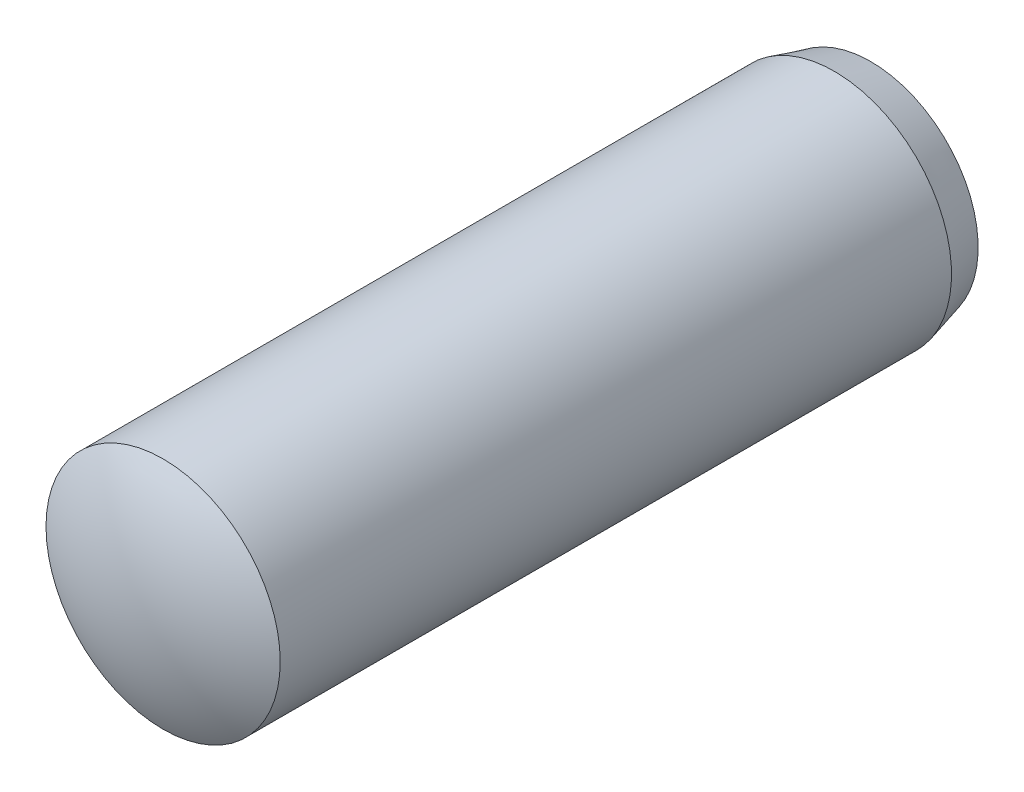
ISO-10303-21;
HEADER;
FILE_DESCRIPTION(('STEP AP214'),'2;1');
FILE_NAME('part.step','',(''),(''),'','','');
FILE_SCHEMA(('AUTOMOTIVE_DESIGN { 1 0 10303 214 1 1 1 1 }'));
ENDSEC;
DATA;
#1=APPLICATION_CONTEXT('core data for automotive mechanical design processes');
#2=APPLICATION_PROTOCOL_DEFINITION('international standard','automotive_design',2000,#1);
#3=PRODUCT_CONTEXT('',#1,'mechanical');
#4=PRODUCT('Part','Part','',(#3));
#5=PRODUCT_RELATED_PRODUCT_CATEGORY('part','',(#4));
#6=PRODUCT_DEFINITION_FORMATION('','',#4);
#7=PRODUCT_DEFINITION_CONTEXT('part definition',#1,'design');
#8=PRODUCT_DEFINITION('design','',#6,#7);
#9=PRODUCT_DEFINITION_SHAPE('','',#8);
#10=(LENGTH_UNIT() NAMED_UNIT(*) SI_UNIT(.MILLI.,.METRE.));
#11=(NAMED_UNIT(*) PLANE_ANGLE_UNIT() SI_UNIT($,.RADIAN.));
#12=(NAMED_UNIT(*) SI_UNIT($,.STERADIAN.) SOLID_ANGLE_UNIT());
#13=UNCERTAINTY_MEASURE_WITH_UNIT(LENGTH_MEASURE(1.E-05),#10,'distance_accuracy_value','');
#14=(GEOMETRIC_REPRESENTATION_CONTEXT(3) GLOBAL_UNCERTAINTY_ASSIGNED_CONTEXT((#13)) GLOBAL_UNIT_ASSIGNED_CONTEXT((#10,
#11,#12)) REPRESENTATION_CONTEXT('',''));
#15=CARTESIAN_POINT('',(0.,0.,0.));
#16=DIRECTION('',(0.,0.,1.));
#17=DIRECTION('',(1.,0.,0.));
#18=AXIS2_PLACEMENT_3D('',#15,#16,#17);
#19=CARTESIAN_POINT('',(0.,0.,-4.9));
#20=DIRECTION('',(0.,0.,1.));
#21=DIRECTION('',(1.,0.,0.));
#22=AXIS2_PLACEMENT_3D('',#19,#20,#21);
#23=CONICAL_SURFACE('',#22,1.2856406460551,0.261799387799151);
#24=CARTESIAN_POINT('',(0.,0.,-4.1));
#25=DIRECTION('',(0.,0.,-1.));
#26=DIRECTION('',(-1.,0.,0.));
#27=AXIS2_PLACEMENT_3D('',#24,#25,#26);
#28=CIRCLE('',#27,1.5);
#29=CARTESIAN_POINT('',(-1.5,0.,-4.1));
#30=VERTEX_POINT('',#29);
#31=EDGE_CURVE('E11',#30,#30,#28,.T.);
#32=ORIENTED_EDGE('',*,*,#31,.T.);
#33=EDGE_LOOP('',(#32));
#34=FACE_BOUND('',#33,.T.);
#35=CARTESIAN_POINT('',(0.,0.,-4.56631463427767));
#36=DIRECTION('',(0.,0.,-1.));
#37=DIRECTION('',(-1.,0.,0.));
#38=AXIS2_PLACEMENT_3D('',#35,#36,#37);
#39=CIRCLE('',#38,1.37505137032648);
#40=CARTESIAN_POINT('',(-1.37505137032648,0.,-4.56631463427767));
#41=VERTEX_POINT('',#40);
#42=EDGE_CURVE('E46',#41,#41,#39,.T.);
#43=ORIENTED_EDGE('',*,*,#42,.F.);
#44=EDGE_LOOP('',(#43));
#45=FACE_BOUND('',#44,.T.);
#46=ADVANCED_FACE('F38',(#34,#45),#23,.T.);
#47=CARTESIAN_POINT('',(0.,0.,4.9));
#48=DIRECTION('',(0.,0.,-1.));
#49=DIRECTION('',(-1.,0.,0.));
#50=AXIS2_PLACEMENT_3D('',#47,#48,#49);
#51=CYLINDRICAL_SURFACE('',#50,1.5);
#52=CARTESIAN_POINT('',(0.,0.,4.49807621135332));
#53=DIRECTION('',(0.,0.,1.));
#54=DIRECTION('',(1.,0.,0.));
#55=AXIS2_PLACEMENT_3D('',#52,#53,#54);
#56=CIRCLE('',#55,1.5);
#57=CARTESIAN_POINT('',(1.5,0.,4.49807621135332));
#58=VERTEX_POINT('',#57);
#59=EDGE_CURVE('E59',#58,#58,#56,.T.);
#60=ORIENTED_EDGE('',*,*,#59,.F.);
#61=EDGE_LOOP('',(#60));
#62=FACE_BOUND('',#61,.T.);
#63=ORIENTED_EDGE('',*,*,#31,.F.);
#64=EDGE_LOOP('',(#63));
#65=FACE_BOUND('',#64,.T.);
#66=ADVANCED_FACE('F40',(#62,#65),#51,.T.);
#67=CARTESIAN_POINT('',(0.,0.,-1.9));
#68=DIRECTION('',(0.,0.,-1.));
#69=DIRECTION('',(-1.,0.,0.));
#70=AXIS2_PLACEMENT_3D('',#67,#68,#69);
#71=SPHERICAL_SURFACE('',#70,3.);
#72=CARTESIAN_POINT('',(0.,0.,-4.9));
#73=VERTEX_POINT('',#72);
#74=VERTEX_LOOP('',#73);
#75=FACE_BOUND('',#74,.T.);
#76=ORIENTED_EDGE('',*,*,#42,.T.);
#77=EDGE_LOOP('',(#76));
#78=FACE_BOUND('',#77,.T.);
#79=ADVANCED_FACE('F55',(#75,#78),#71,.T.);
#80=CARTESIAN_POINT('',(0.,0.,1.9));
#81=DIRECTION('',(0.,0.,1.));
#82=DIRECTION('',(-1.,0.,0.));
#83=AXIS2_PLACEMENT_3D('',#80,#81,#82);
#84=SPHERICAL_SURFACE('',#83,3.);
#85=CARTESIAN_POINT('',(0.,0.,4.9));
#86=VERTEX_POINT('',#85);
#87=VERTEX_LOOP('',#86);
#88=FACE_BOUND('',#87,.T.);
#89=ORIENTED_EDGE('',*,*,#59,.T.);
#90=EDGE_LOOP('',(#89));
#91=FACE_BOUND('',#90,.T.);
#92=ADVANCED_FACE('F52',(#88,#91),#84,.T.);
#93=CLOSED_SHELL('',(#46,#66,#79,#92));
#94=MANIFOLD_SOLID_BREP('B2',#93);
#95=ADVANCED_BREP_SHAPE_REPRESENTATION('',(#18,#94),#14);
#96=SHAPE_DEFINITION_REPRESENTATION(#9,#95);
ENDSEC;
END-ISO-10303-21;
